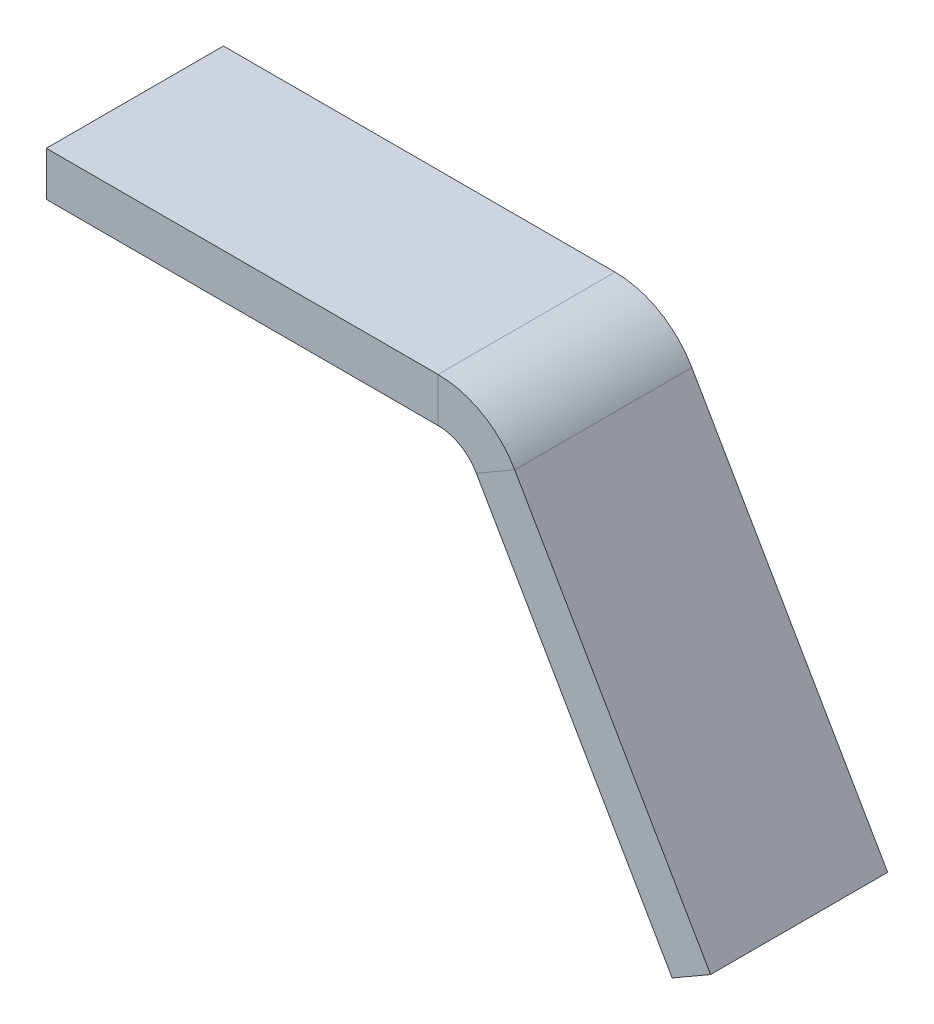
ISO-10303-21;
HEADER;
FILE_DESCRIPTION(('STEP AP214'),'2;1');
FILE_NAME('part.step','',(''),(''),'','','');
FILE_SCHEMA(('AUTOMOTIVE_DESIGN { 1 0 10303 214 1 1 1 1 }'));
ENDSEC;
DATA;
#1=APPLICATION_CONTEXT('core data for automotive mechanical design processes');
#2=APPLICATION_PROTOCOL_DEFINITION('international standard','automotive_design',2000,#1);
#3=PRODUCT_CONTEXT('',#1,'mechanical');
#4=PRODUCT('Part','Part','',(#3));
#5=PRODUCT_RELATED_PRODUCT_CATEGORY('part','',(#4));
#6=PRODUCT_DEFINITION_FORMATION('','',#4);
#7=PRODUCT_DEFINITION_CONTEXT('part definition',#1,'design');
#8=PRODUCT_DEFINITION('design','',#6,#7);
#9=PRODUCT_DEFINITION_SHAPE('','',#8);
#10=(LENGTH_UNIT() NAMED_UNIT(*) SI_UNIT(.MILLI.,.METRE.));
#11=(NAMED_UNIT(*) PLANE_ANGLE_UNIT() SI_UNIT($,.RADIAN.));
#12=(NAMED_UNIT(*) SI_UNIT($,.STERADIAN.) SOLID_ANGLE_UNIT());
#13=UNCERTAINTY_MEASURE_WITH_UNIT(LENGTH_MEASURE(1.E-05),#10,'distance_accuracy_value','');
#14=(GEOMETRIC_REPRESENTATION_CONTEXT(3) GLOBAL_UNCERTAINTY_ASSIGNED_CONTEXT((#13)) GLOBAL_UNIT_ASSIGNED_CONTEXT((#10,
#11,#12)) REPRESENTATION_CONTEXT('',''));
#15=CARTESIAN_POINT('',(0.,0.,0.));
#16=DIRECTION('',(0.,0.,1.));
#17=DIRECTION('',(1.,0.,0.));
#18=AXIS2_PLACEMENT_3D('',#15,#16,#17);
#19=CARTESIAN_POINT('',(2.88675134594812,-5.00000000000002,20.));
#20=DIRECTION('',(0.,0.,1.));
#21=DIRECTION('',(1.,0.,0.));
#22=AXIS2_PLACEMENT_3D('',#19,#20,#21);
#23=PLANE('',#22);
#24=DIRECTION('',(-0.86602540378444,-0.499999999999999,0.));
#25=VECTOR('',#24,1.);
#26=CARTESIAN_POINT('',(2.88675134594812,-5.00000000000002,20.));
#27=LINE('',#26,#25);
#28=CARTESIAN_POINT('',(2.88675134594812,-5.00000000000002,20.));
#29=VERTEX_POINT('',#28);
#30=CARTESIAN_POINT('',(-1.44337567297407,-7.50000000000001,20.));
#31=VERTEX_POINT('',#30);
#32=EDGE_CURVE('E11',#29,#31,#27,.T.);
#33=ORIENTED_EDGE('',*,*,#32,.F.);
#34=CARTESIAN_POINT('',(-5.77350269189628,-10.,20.));
#35=DIRECTION('',(0.,0.,1.));
#36=DIRECTION('',(1.,0.,0.));
#37=AXIS2_PLACEMENT_3D('',#34,#35,#36);
#38=CIRCLE('',#37,10.);
#39=CARTESIAN_POINT('',(-5.77350269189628,0.,20.));
#40=VERTEX_POINT('',#39);
#41=EDGE_CURVE('E134',#40,#29,#38,.F.);
#42=ORIENTED_EDGE('',*,*,#41,.F.);
#43=DIRECTION('',(0.,1.,0.));
#44=VECTOR('',#43,1.);
#45=CARTESIAN_POINT('',(-5.77350269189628,-5.,20.));
#46=LINE('',#45,#44);
#47=CARTESIAN_POINT('',(-5.77350269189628,-5.,20.));
#48=VERTEX_POINT('',#47);
#49=EDGE_CURVE('E45',#48,#40,#46,.T.);
#50=ORIENTED_EDGE('',*,*,#49,.F.);
#51=CARTESIAN_POINT('',(-5.77350269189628,-10.,20.));
#52=DIRECTION('',(0.,0.,1.));
#53=DIRECTION('',(1.,0.,0.));
#54=AXIS2_PLACEMENT_3D('',#51,#52,#53);
#55=CIRCLE('',#54,5.);
#56=EDGE_CURVE('E127',#48,#31,#55,.F.);
#57=ORIENTED_EDGE('',*,*,#56,.T.);
#58=EDGE_LOOP('',(#33,#42,#50,#57));
#59=FACE_BOUND('',#58,.T.);
#60=ADVANCED_FACE('F37',(#59),#23,.T.);
#61=CARTESIAN_POINT('',(-5.77350269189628,-5.,20.));
#62=DIRECTION('',(0.,0.,1.));
#63=DIRECTION('',(1.,0.,0.));
#64=AXIS2_PLACEMENT_3D('',#61,#62,#63);
#65=PLANE('',#64);
#66=DIRECTION('',(0.499999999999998,-0.86602540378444,0.));
#67=VECTOR('',#66,1.);
#68=CARTESIAN_POINT('',(0.,0.,20.));
#69=LINE('',#68,#67);
#70=CARTESIAN_POINT('',(24.9999999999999,-43.301270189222,20.));
#71=VERTEX_POINT('',#70);
#72=EDGE_CURVE('E183',#29,#71,#69,.T.);
#73=ORIENTED_EDGE('',*,*,#72,.F.);
#74=ORIENTED_EDGE('',*,*,#32,.T.);
#75=DIRECTION('',(0.499999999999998,-0.86602540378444,0.));
#76=VECTOR('',#75,1.);
#77=CARTESIAN_POINT('',(-4.3301270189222,-2.49999999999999,20.));
#78=LINE('',#77,#76);
#79=CARTESIAN_POINT('',(20.6698729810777,-45.801270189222,20.));
#80=VERTEX_POINT('',#79);
#81=EDGE_CURVE('E93',#31,#80,#78,.T.);
#82=ORIENTED_EDGE('',*,*,#81,.T.);
#83=DIRECTION('',(-0.866025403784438,-0.500000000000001,0.));
#84=VECTOR('',#83,1.);
#85=CARTESIAN_POINT('',(24.9999999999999,-43.301270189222,20.));
#86=LINE('',#85,#84);
#87=EDGE_CURVE('E340',#71,#80,#86,.T.);
#88=ORIENTED_EDGE('',*,*,#87,.F.);
#89=EDGE_LOOP('',(#73,#74,#82,#88));
#90=FACE_BOUND('',#89,.T.);
#91=ADVANCED_FACE('F191',(#90),#65,.T.);
#92=CARTESIAN_POINT('',(-5.77350269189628,0.,0.));
#93=DIRECTION('',(0.,0.,-1.));
#94=DIRECTION('',(-1.,0.,0.));
#95=AXIS2_PLACEMENT_3D('',#92,#93,#94);
#96=PLANE('',#95);
#97=DIRECTION('',(0.,-1.,0.));
#98=VECTOR('',#97,1.);
#99=CARTESIAN_POINT('',(-5.77350269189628,0.,0.));
#100=LINE('',#99,#98);
#101=CARTESIAN_POINT('',(-5.77350269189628,0.,0.));
#102=VERTEX_POINT('',#101);
#103=CARTESIAN_POINT('',(-5.77350269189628,-5.,0.));
#104=VERTEX_POINT('',#103);
#105=EDGE_CURVE('E80',#102,#104,#100,.T.);
#106=ORIENTED_EDGE('',*,*,#105,.F.);
#107=CARTESIAN_POINT('',(-5.77350269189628,-10.,0.));
#108=DIRECTION('',(0.,0.,1.));
#109=DIRECTION('',(1.,0.,0.));
#110=AXIS2_PLACEMENT_3D('',#107,#108,#109);
#111=CIRCLE('',#110,10.);
#112=CARTESIAN_POINT('',(2.88675134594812,-5.00000000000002,0.));
#113=VERTEX_POINT('',#112);
#114=EDGE_CURVE('E149',#102,#113,#111,.F.);
#115=ORIENTED_EDGE('',*,*,#114,.T.);
#116=DIRECTION('',(0.86602540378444,0.499999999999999,0.));
#117=VECTOR('',#116,1.);
#118=CARTESIAN_POINT('',(-1.44337567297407,-7.50000000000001,0.));
#119=LINE('',#118,#117);
#120=CARTESIAN_POINT('',(-1.44337567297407,-7.50000000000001,0.));
#121=VERTEX_POINT('',#120);
#122=EDGE_CURVE('E87',#121,#113,#119,.T.);
#123=ORIENTED_EDGE('',*,*,#122,.F.);
#124=CARTESIAN_POINT('',(-5.77350269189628,-10.,0.));
#125=DIRECTION('',(0.,0.,1.));
#126=DIRECTION('',(1.,0.,0.));
#127=AXIS2_PLACEMENT_3D('',#124,#125,#126);
#128=CIRCLE('',#127,5.);
#129=EDGE_CURVE('E156',#104,#121,#128,.F.);
#130=ORIENTED_EDGE('',*,*,#129,.F.);
#131=EDGE_LOOP('',(#106,#115,#123,#130));
#132=FACE_BOUND('',#131,.T.);
#133=ADVANCED_FACE('F189',(#132),#96,.T.);
#134=CARTESIAN_POINT('',(-1.44337567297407,-7.50000000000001,0.));
#135=DIRECTION('',(0.,0.,-1.));
#136=DIRECTION('',(-1.,0.,0.));
#137=AXIS2_PLACEMENT_3D('',#134,#135,#136);
#138=PLANE('',#137);
#139=DIRECTION('',(1.,0.,0.));
#140=VECTOR('',#139,1.);
#141=CARTESIAN_POINT('',(-50.,0.,0.));
#142=LINE('',#141,#140);
#143=CARTESIAN_POINT('',(-50.,0.,0.));
#144=VERTEX_POINT('',#143);
#145=EDGE_CURVE('E151',#144,#102,#142,.T.);
#146=ORIENTED_EDGE('',*,*,#145,.T.);
#147=ORIENTED_EDGE('',*,*,#105,.T.);
#148=DIRECTION('',(1.,0.,0.));
#149=VECTOR('',#148,1.);
#150=CARTESIAN_POINT('',(-50.,-5.,0.));
#151=LINE('',#150,#149);
#152=CARTESIAN_POINT('',(-50.,-5.,0.));
#153=VERTEX_POINT('',#152);
#154=EDGE_CURVE('E154',#153,#104,#151,.T.);
#155=ORIENTED_EDGE('',*,*,#154,.F.);
#156=DIRECTION('',(0.,1.,0.));
#157=VECTOR('',#156,1.);
#158=CARTESIAN_POINT('',(-50.,-5.,0.));
#159=LINE('',#158,#157);
#160=EDGE_CURVE('E115',#153,#144,#159,.T.);
#161=ORIENTED_EDGE('',*,*,#160,.T.);
#162=EDGE_LOOP('',(#146,#147,#155,#161));
#163=FACE_BOUND('',#162,.T.);
#164=ADVANCED_FACE('F185',(#163),#138,.T.);
#165=CARTESIAN_POINT('',(-4.3301270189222,-2.49999999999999,20.));
#166=DIRECTION('',(0.86602540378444,0.499999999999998,0.));
#167=DIRECTION('',(-0.499999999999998,0.86602540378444,0.));
#168=AXIS2_PLACEMENT_3D('',#165,#166,#167);
#169=PLANE('',#168);
#170=DIRECTION('',(0.499999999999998,-0.86602540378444,0.));
#171=VECTOR('',#170,1.);
#172=CARTESIAN_POINT('',(-4.3301270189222,-2.49999999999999,0.));
#173=LINE('',#172,#171);
#174=CARTESIAN_POINT('',(20.6698729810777,-45.801270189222,0.));
#175=VERTEX_POINT('',#174);
#176=EDGE_CURVE('E140',#121,#175,#173,.T.);
#177=ORIENTED_EDGE('',*,*,#176,.T.);
#178=DIRECTION('',(0.,0.,-1.));
#179=VECTOR('',#178,1.);
#180=CARTESIAN_POINT('',(20.6698729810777,-45.801270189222,20.));
#181=LINE('',#180,#179);
#182=EDGE_CURVE('E170',#80,#175,#181,.T.);
#183=ORIENTED_EDGE('',*,*,#182,.F.);
#184=ORIENTED_EDGE('',*,*,#81,.F.);
#185=DIRECTION('',(0.,0.,-1.));
#186=VECTOR('',#185,1.);
#187=CARTESIAN_POINT('',(-1.44337567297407,-7.50000000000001,20.));
#188=LINE('',#187,#186);
#189=EDGE_CURVE('E139',#31,#121,#188,.T.);
#190=ORIENTED_EDGE('',*,*,#189,.T.);
#191=EDGE_LOOP('',(#177,#183,#184,#190));
#192=FACE_BOUND('',#191,.T.);
#193=ADVANCED_FACE('F197',(#192),#169,.F.);
#194=CARTESIAN_POINT('',(24.9999999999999,-43.301270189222,20.));
#195=DIRECTION('',(0.500000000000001,-0.866025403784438,0.));
#196=DIRECTION('',(0.866025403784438,0.500000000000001,0.));
#197=AXIS2_PLACEMENT_3D('',#194,#195,#196);
#198=PLANE('',#197);
#199=DIRECTION('',(-0.866025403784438,-0.500000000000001,0.));
#200=VECTOR('',#199,1.);
#201=CARTESIAN_POINT('',(24.9999999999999,-43.301270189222,0.));
#202=LINE('',#201,#200);
#203=CARTESIAN_POINT('',(24.9999999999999,-43.301270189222,0.));
#204=VERTEX_POINT('',#203);
#205=EDGE_CURVE('E143',#204,#175,#202,.T.);
#206=ORIENTED_EDGE('',*,*,#205,.F.);
#207=DIRECTION('',(0.,0.,-1.));
#208=VECTOR('',#207,1.);
#209=CARTESIAN_POINT('',(24.9999999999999,-43.301270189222,20.));
#210=LINE('',#209,#208);
#211=EDGE_CURVE('E168',#71,#204,#210,.T.);
#212=ORIENTED_EDGE('',*,*,#211,.F.);
#213=ORIENTED_EDGE('',*,*,#87,.T.);
#214=ORIENTED_EDGE('',*,*,#182,.T.);
#215=EDGE_LOOP('',(#206,#212,#213,#214));
#216=FACE_BOUND('',#215,.T.);
#217=ADVANCED_FACE('F228',(#216),#198,.T.);
#218=CARTESIAN_POINT('',(0.,0.,20.));
#219=DIRECTION('',(0.86602540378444,0.499999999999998,0.));
#220=DIRECTION('',(-0.499999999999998,0.86602540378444,0.));
#221=AXIS2_PLACEMENT_3D('',#218,#219,#220);
#222=PLANE('',#221);
#223=DIRECTION('',(0.499999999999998,-0.86602540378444,0.));
#224=VECTOR('',#223,1.);
#225=CARTESIAN_POINT('',(0.,0.,0.));
#226=LINE('',#225,#224);
#227=EDGE_CURVE('E146',#113,#204,#226,.T.);
#228=ORIENTED_EDGE('',*,*,#227,.F.);
#229=DIRECTION('',(0.,0.,-1.));
#230=VECTOR('',#229,1.);
#231=CARTESIAN_POINT('',(2.88675134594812,-5.00000000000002,20.));
#232=LINE('',#231,#230);
#233=EDGE_CURVE('E165',#29,#113,#232,.T.);
#234=ORIENTED_EDGE('',*,*,#233,.F.);
#235=ORIENTED_EDGE('',*,*,#72,.T.);
#236=ORIENTED_EDGE('',*,*,#211,.T.);
#237=EDGE_LOOP('',(#228,#234,#235,#236));
#238=FACE_BOUND('',#237,.T.);
#239=ADVANCED_FACE('F239',(#238),#222,.T.);
#240=CARTESIAN_POINT('',(-5.77350269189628,-10.,20.));
#241=DIRECTION('',(0.,0.,-1.));
#242=DIRECTION('',(-1.,0.,0.));
#243=AXIS2_PLACEMENT_3D('',#240,#241,#242);
#244=CYLINDRICAL_SURFACE('',#243,10.);
#245=ORIENTED_EDGE('',*,*,#114,.F.);
#246=DIRECTION('',(0.,0.,-1.));
#247=VECTOR('',#246,1.);
#248=CARTESIAN_POINT('',(-5.77350269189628,0.,20.));
#249=LINE('',#248,#247);
#250=EDGE_CURVE('E162',#40,#102,#249,.T.);
#251=ORIENTED_EDGE('',*,*,#250,.F.);
#252=ORIENTED_EDGE('',*,*,#41,.T.);
#253=ORIENTED_EDGE('',*,*,#233,.T.);
#254=EDGE_LOOP('',(#245,#251,#252,#253));
#255=FACE_BOUND('',#254,.T.);
#256=ADVANCED_FACE('F179',(#255),#244,.T.);
#257=CARTESIAN_POINT('',(-50.,0.,20.));
#258=DIRECTION('',(0.,1.,0.));
#259=DIRECTION('',(0.,0.,1.));
#260=AXIS2_PLACEMENT_3D('',#257,#258,#259);
#261=PLANE('',#260);
#262=ORIENTED_EDGE('',*,*,#145,.F.);
#263=DIRECTION('',(0.,0.,-1.));
#264=VECTOR('',#263,1.);
#265=CARTESIAN_POINT('',(-50.,0.,20.));
#266=LINE('',#265,#264);
#267=CARTESIAN_POINT('',(-50.,0.,20.));
#268=VERTEX_POINT('',#267);
#269=EDGE_CURVE('E117',#268,#144,#266,.T.);
#270=ORIENTED_EDGE('',*,*,#269,.F.);
#271=DIRECTION('',(1.,0.,0.));
#272=VECTOR('',#271,1.);
#273=CARTESIAN_POINT('',(-50.,0.,20.));
#274=LINE('',#273,#272);
#275=EDGE_CURVE('E132',#268,#40,#274,.T.);
#276=ORIENTED_EDGE('',*,*,#275,.T.);
#277=ORIENTED_EDGE('',*,*,#250,.T.);
#278=EDGE_LOOP('',(#262,#270,#276,#277));
#279=FACE_BOUND('',#278,.T.);
#280=ADVANCED_FACE('F184',(#279),#261,.T.);
#281=CARTESIAN_POINT('',(-50.,-5.,20.));
#282=DIRECTION('',(-1.,0.,0.));
#283=DIRECTION('',(0.,0.,1.));
#284=AXIS2_PLACEMENT_3D('',#281,#282,#283);
#285=PLANE('',#284);
#286=ORIENTED_EDGE('',*,*,#160,.F.);
#287=DIRECTION('',(0.,0.,-1.));
#288=VECTOR('',#287,1.);
#289=CARTESIAN_POINT('',(-50.,-5.,20.));
#290=LINE('',#289,#288);
#291=CARTESIAN_POINT('',(-50.,-5.,20.));
#292=VERTEX_POINT('',#291);
#293=EDGE_CURVE('E109',#292,#153,#290,.T.);
#294=ORIENTED_EDGE('',*,*,#293,.F.);
#295=DIRECTION('',(0.,1.,0.));
#296=VECTOR('',#295,1.);
#297=CARTESIAN_POINT('',(-50.,-5.,20.));
#298=LINE('',#297,#296);
#299=EDGE_CURVE('E113',#292,#268,#298,.T.);
#300=ORIENTED_EDGE('',*,*,#299,.T.);
#301=ORIENTED_EDGE('',*,*,#269,.T.);
#302=EDGE_LOOP('',(#286,#294,#300,#301));
#303=FACE_BOUND('',#302,.T.);
#304=ADVANCED_FACE('F111',(#303),#285,.T.);
#305=CARTESIAN_POINT('',(-50.,-5.,20.));
#306=DIRECTION('',(0.,1.,0.));
#307=DIRECTION('',(0.,0.,1.));
#308=AXIS2_PLACEMENT_3D('',#305,#306,#307);
#309=PLANE('',#308);
#310=ORIENTED_EDGE('',*,*,#154,.T.);
#311=DIRECTION('',(0.,0.,-1.));
#312=VECTOR('',#311,1.);
#313=CARTESIAN_POINT('',(-5.77350269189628,-5.,20.));
#314=LINE('',#313,#312);
#315=EDGE_CURVE('E118',#48,#104,#314,.T.);
#316=ORIENTED_EDGE('',*,*,#315,.F.);
#317=DIRECTION('',(1.,0.,0.));
#318=VECTOR('',#317,1.);
#319=CARTESIAN_POINT('',(-50.,-5.,20.));
#320=LINE('',#319,#318);
#321=EDGE_CURVE('E122',#292,#48,#320,.T.);
#322=ORIENTED_EDGE('',*,*,#321,.F.);
#323=ORIENTED_EDGE('',*,*,#293,.T.);
#324=EDGE_LOOP('',(#310,#316,#322,#323));
#325=FACE_BOUND('',#324,.T.);
#326=ADVANCED_FACE('F123',(#325),#309,.F.);
#327=CARTESIAN_POINT('',(-5.77350269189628,-10.,20.));
#328=DIRECTION('',(0.,0.,-1.));
#329=DIRECTION('',(-1.,0.,0.));
#330=AXIS2_PLACEMENT_3D('',#327,#328,#329);
#331=CYLINDRICAL_SURFACE('',#330,5.);
#332=ORIENTED_EDGE('',*,*,#129,.T.);
#333=ORIENTED_EDGE('',*,*,#189,.F.);
#334=ORIENTED_EDGE('',*,*,#56,.F.);
#335=ORIENTED_EDGE('',*,*,#315,.T.);
#336=EDGE_LOOP('',(#332,#333,#334,#335));
#337=FACE_BOUND('',#336,.T.);
#338=ADVANCED_FACE('F187',(#337),#331,.F.);
#339=CARTESIAN_POINT('',(-5.77350269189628,-10.,20.));
#340=DIRECTION('',(0.,0.,1.));
#341=DIRECTION('',(1.,0.,0.));
#342=AXIS2_PLACEMENT_3D('',#339,#340,#341);
#343=PLANE('',#342);
#344=ORIENTED_EDGE('',*,*,#321,.T.);
#345=ORIENTED_EDGE('',*,*,#49,.T.);
#346=ORIENTED_EDGE('',*,*,#275,.F.);
#347=ORIENTED_EDGE('',*,*,#299,.F.);
#348=EDGE_LOOP('',(#344,#345,#346,#347));
#349=FACE_BOUND('',#348,.T.);
#350=ADVANCED_FACE('F130',(#349),#343,.T.);
#351=CARTESIAN_POINT('',(-5.77350269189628,-10.,0.));
#352=DIRECTION('',(0.,0.,1.));
#353=DIRECTION('',(1.,0.,0.));
#354=AXIS2_PLACEMENT_3D('',#351,#352,#353);
#355=PLANE('',#354);
#356=ORIENTED_EDGE('',*,*,#176,.F.);
#357=ORIENTED_EDGE('',*,*,#122,.T.);
#358=ORIENTED_EDGE('',*,*,#227,.T.);
#359=ORIENTED_EDGE('',*,*,#205,.T.);
#360=EDGE_LOOP('',(#356,#357,#358,#359));
#361=FACE_BOUND('',#360,.T.);
#362=ADVANCED_FACE('F305',(#361),#355,.F.);
#363=CLOSED_SHELL('',(#60,#91,#133,#164,#193,#217,#239,#256,#280,#304,#326,#338,#350,#362));
#364=MANIFOLD_SOLID_BREP('B2',#363);
#365=ADVANCED_BREP_SHAPE_REPRESENTATION('',(#18,#364),#14);
#366=SHAPE_DEFINITION_REPRESENTATION(#9,#365);
ENDSEC;
END-ISO-10303-21;
